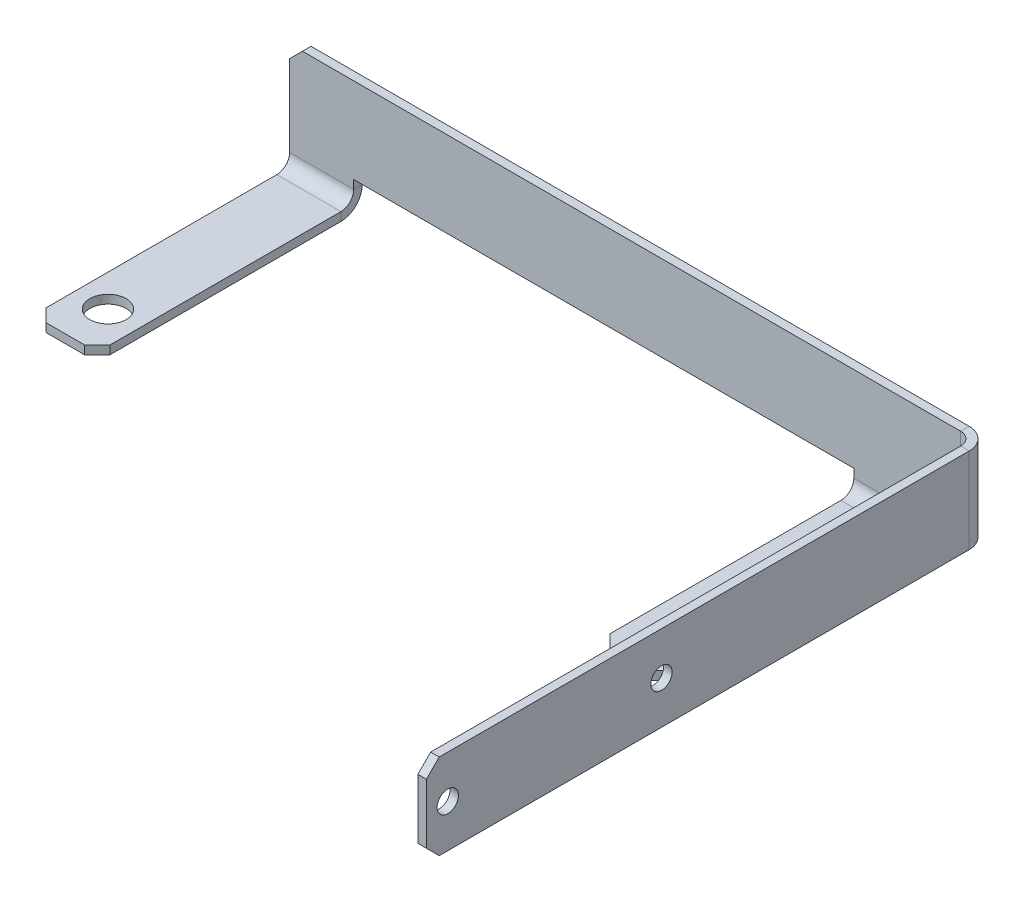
ISO-10303-21;
HEADER;
FILE_DESCRIPTION(('STEP AP214'),'2;1');
FILE_NAME('part.step','',(''),(''),'','','');
FILE_SCHEMA(('AUTOMOTIVE_DESIGN { 1 0 10303 214 1 1 1 1 }'));
ENDSEC;
DATA;
#1=APPLICATION_CONTEXT('core data for automotive mechanical design processes');
#2=APPLICATION_PROTOCOL_DEFINITION('international standard','automotive_design',2000,#1);
#3=PRODUCT_CONTEXT('',#1,'mechanical');
#4=PRODUCT('Part','Part','',(#3));
#5=PRODUCT_RELATED_PRODUCT_CATEGORY('part','',(#4));
#6=PRODUCT_DEFINITION_FORMATION('','',#4);
#7=PRODUCT_DEFINITION_CONTEXT('part definition',#1,'design');
#8=PRODUCT_DEFINITION('design','',#6,#7);
#9=PRODUCT_DEFINITION_SHAPE('','',#8);
#10=(LENGTH_UNIT() NAMED_UNIT(*) SI_UNIT(.MILLI.,.METRE.));
#11=(NAMED_UNIT(*) PLANE_ANGLE_UNIT() SI_UNIT($,.RADIAN.));
#12=(NAMED_UNIT(*) SI_UNIT($,.STERADIAN.) SOLID_ANGLE_UNIT());
#13=UNCERTAINTY_MEASURE_WITH_UNIT(LENGTH_MEASURE(1.E-05),#10,'distance_accuracy_value','');
#14=(GEOMETRIC_REPRESENTATION_CONTEXT(3) GLOBAL_UNCERTAINTY_ASSIGNED_CONTEXT((#13)) GLOBAL_UNIT_ASSIGNED_CONTEXT((#10,
#11,#12)) REPRESENTATION_CONTEXT('',''));
#15=CARTESIAN_POINT('',(0.,0.,0.));
#16=DIRECTION('',(0.,0.,1.));
#17=DIRECTION('',(1.,0.,0.));
#18=AXIS2_PLACEMENT_3D('',#15,#16,#17);
#19=CARTESIAN_POINT('',(81.,-9.99999999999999,2.));
#20=DIRECTION('',(0.,0.,-1.));
#21=DIRECTION('',(-1.,0.,0.));
#22=AXIS2_PLACEMENT_3D('',#19,#20,#21);
#23=PLANE('',#22);
#24=DIRECTION('',(-1.,0.,0.));
#25=VECTOR('',#24,1.);
#26=CARTESIAN_POINT('',(-81.,10.,2.));
#27=LINE('',#26,#25);
#28=CARTESIAN_POINT('',(76.,10.,2.00000000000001));
#29=VERTEX_POINT('',#28);
#30=CARTESIAN_POINT('',(-78.,10.,2.));
#31=VERTEX_POINT('',#30);
#32=EDGE_CURVE('E417',#29,#31,#27,.T.);
#33=ORIENTED_EDGE('',*,*,#32,.T.);
#34=DIRECTION('',(0.707106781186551,0.707106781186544,0.));
#35=VECTOR('',#34,1.);
#36=CARTESIAN_POINT('',(-81.,7.00000000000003,2.));
#37=LINE('',#36,#35);
#38=CARTESIAN_POINT('',(-81.,7.00000000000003,2.));
#39=VERTEX_POINT('',#38);
#40=EDGE_CURVE('E463',#31,#39,#37,.F.);
#41=ORIENTED_EDGE('',*,*,#40,.T.);
#42=DIRECTION('',(0.,-1.,0.));
#43=VECTOR('',#42,1.);
#44=CARTESIAN_POINT('',(-81.,10.,2.));
#45=LINE('',#44,#43);
#46=CARTESIAN_POINT('',(-81.,-12.,2.));
#47=VERTEX_POINT('',#46);
#48=EDGE_CURVE('E421',#39,#47,#45,.T.);
#49=ORIENTED_EDGE('',*,*,#48,.T.);
#50=DIRECTION('',(1.,0.,0.));
#51=VECTOR('',#50,1.);
#52=CARTESIAN_POINT('',(-66.,-12.,2.));
#53=LINE('',#52,#51);
#54=CARTESIAN_POINT('',(-66.,-12.,2.));
#55=VERTEX_POINT('',#54);
#56=EDGE_CURVE('E403',#55,#47,#53,.F.);
#57=ORIENTED_EDGE('',*,*,#56,.F.);
#58=DIRECTION('',(0.,1.,0.));
#59=VECTOR('',#58,1.);
#60=CARTESIAN_POINT('',(-66.,-9.99999999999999,2.));
#61=LINE('',#60,#59);
#62=CARTESIAN_POINT('',(-66.,-9.99999999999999,2.));
#63=VERTEX_POINT('',#62);
#64=EDGE_CURVE('E423',#55,#63,#61,.T.);
#65=ORIENTED_EDGE('',*,*,#64,.T.);
#66=DIRECTION('',(1.,0.,0.));
#67=VECTOR('',#66,1.);
#68=CARTESIAN_POINT('',(-66.,-9.99999999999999,2.));
#69=LINE('',#68,#67);
#70=CARTESIAN_POINT('',(51.,-9.99999999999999,2.));
#71=VERTEX_POINT('',#70);
#72=EDGE_CURVE('E425',#63,#71,#69,.T.);
#73=ORIENTED_EDGE('',*,*,#72,.T.);
#74=DIRECTION('',(0.,-1.,0.));
#75=VECTOR('',#74,1.);
#76=CARTESIAN_POINT('',(51.,-9.99999999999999,2.));
#77=LINE('',#76,#75);
#78=CARTESIAN_POINT('',(51.,-12.,2.));
#79=VERTEX_POINT('',#78);
#80=EDGE_CURVE('E427',#71,#79,#77,.T.);
#81=ORIENTED_EDGE('',*,*,#80,.T.);
#82=DIRECTION('',(1.,0.,0.));
#83=VECTOR('',#82,1.);
#84=CARTESIAN_POINT('',(66.,-12.,2.));
#85=LINE('',#84,#83);
#86=CARTESIAN_POINT('',(66.,-12.,2.));
#87=VERTEX_POINT('',#86);
#88=EDGE_CURVE('E356',#87,#79,#85,.F.);
#89=ORIENTED_EDGE('',*,*,#88,.F.);
#90=DIRECTION('',(0.,1.,0.));
#91=VECTOR('',#90,1.);
#92=CARTESIAN_POINT('',(66.,-9.99999999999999,2.));
#93=LINE('',#92,#91);
#94=CARTESIAN_POINT('',(66.,-9.99999999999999,2.));
#95=VERTEX_POINT('',#94);
#96=EDGE_CURVE('E430',#87,#95,#93,.T.);
#97=ORIENTED_EDGE('',*,*,#96,.T.);
#98=DIRECTION('',(1.,0.,0.));
#99=VECTOR('',#98,1.);
#100=CARTESIAN_POINT('',(66.,-9.99999999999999,2.));
#101=LINE('',#100,#99);
#102=CARTESIAN_POINT('',(76.,-9.99999999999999,2.00000000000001));
#103=VERTEX_POINT('',#102);
#104=EDGE_CURVE('E414',#95,#103,#101,.T.);
#105=ORIENTED_EDGE('',*,*,#104,.T.);
#106=DIRECTION('',(0.,1.,0.));
#107=VECTOR('',#106,1.);
#108=CARTESIAN_POINT('',(76.,10.,2.00000000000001));
#109=LINE('',#108,#107);
#110=EDGE_CURVE('E308',#29,#103,#109,.F.);
#111=ORIENTED_EDGE('',*,*,#110,.F.);
#112=EDGE_LOOP('',(#33,#41,#49,#57,#65,#73,#81,#89,#97,#105,#111));
#113=FACE_BOUND('',#112,.T.);
#114=ADVANCED_FACE('F54',(#113),#23,.F.);
#115=CARTESIAN_POINT('',(81.,-9.99999999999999,0.));
#116=DIRECTION('',(0.,0.,-1.));
#117=DIRECTION('',(-1.,0.,0.));
#118=AXIS2_PLACEMENT_3D('',#115,#116,#117);
#119=PLANE('',#118);
#120=DIRECTION('',(0.,-1.,0.));
#121=VECTOR('',#120,1.);
#122=CARTESIAN_POINT('',(-81.,-10.,0.));
#123=LINE('',#122,#121);
#124=CARTESIAN_POINT('',(-81.,7.00000000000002,0.));
#125=VERTEX_POINT('',#124);
#126=CARTESIAN_POINT('',(-81.,-12.,0.));
#127=VERTEX_POINT('',#126);
#128=EDGE_CURVE('E438',#125,#127,#123,.T.);
#129=ORIENTED_EDGE('',*,*,#128,.F.);
#130=DIRECTION('',(-0.707106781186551,-0.707106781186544,0.));
#131=VECTOR('',#130,1.);
#132=CARTESIAN_POINT('',(-8.49999999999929,79.5000000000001,0.));
#133=LINE('',#132,#131);
#134=CARTESIAN_POINT('',(-78.,10.,0.));
#135=VERTEX_POINT('',#134);
#136=EDGE_CURVE('E459',#125,#135,#133,.F.);
#137=ORIENTED_EDGE('',*,*,#136,.T.);
#138=DIRECTION('',(-1.,0.,0.));
#139=VECTOR('',#138,1.);
#140=CARTESIAN_POINT('',(-81.,10.,0.));
#141=LINE('',#140,#139);
#142=CARTESIAN_POINT('',(76.,10.,0.));
#143=VERTEX_POINT('',#142);
#144=EDGE_CURVE('E435',#143,#135,#141,.T.);
#145=ORIENTED_EDGE('',*,*,#144,.F.);
#146=DIRECTION('',(0.,1.,0.));
#147=VECTOR('',#146,1.);
#148=CARTESIAN_POINT('',(76.,10.,0.));
#149=LINE('',#148,#147);
#150=CARTESIAN_POINT('',(76.,-9.99999999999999,0.));
#151=VERTEX_POINT('',#150);
#152=EDGE_CURVE('E255',#143,#151,#149,.F.);
#153=ORIENTED_EDGE('',*,*,#152,.T.);
#154=DIRECTION('',(1.,0.,0.));
#155=VECTOR('',#154,1.);
#156=CARTESIAN_POINT('',(66.,-9.99999999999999,0.));
#157=LINE('',#156,#155);
#158=CARTESIAN_POINT('',(66.,-9.99999999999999,0.));
#159=VERTEX_POINT('',#158);
#160=EDGE_CURVE('E411',#159,#151,#157,.T.);
#161=ORIENTED_EDGE('',*,*,#160,.F.);
#162=DIRECTION('',(0.,1.,0.));
#163=VECTOR('',#162,1.);
#164=CARTESIAN_POINT('',(66.,-9.99999999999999,0.));
#165=LINE('',#164,#163);
#166=CARTESIAN_POINT('',(66.,-12.,0.));
#167=VERTEX_POINT('',#166);
#168=EDGE_CURVE('E418',#167,#159,#165,.T.);
#169=ORIENTED_EDGE('',*,*,#168,.F.);
#170=DIRECTION('',(1.,0.,0.));
#171=VECTOR('',#170,1.);
#172=CARTESIAN_POINT('',(66.,-12.,0.));
#173=LINE('',#172,#171);
#174=CARTESIAN_POINT('',(51.,-12.,0.));
#175=VERTEX_POINT('',#174);
#176=EDGE_CURVE('E343',#167,#175,#173,.F.);
#177=ORIENTED_EDGE('',*,*,#176,.T.);
#178=DIRECTION('',(0.,-1.,0.));
#179=VECTOR('',#178,1.);
#180=CARTESIAN_POINT('',(51.,-9.99999999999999,0.));
#181=LINE('',#180,#179);
#182=CARTESIAN_POINT('',(51.,-9.99999999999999,0.));
#183=VERTEX_POINT('',#182);
#184=EDGE_CURVE('E444',#183,#175,#181,.T.);
#185=ORIENTED_EDGE('',*,*,#184,.F.);
#186=DIRECTION('',(1.,0.,0.));
#187=VECTOR('',#186,1.);
#188=CARTESIAN_POINT('',(-66.,-9.99999999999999,0.));
#189=LINE('',#188,#187);
#190=CARTESIAN_POINT('',(-66.,-9.99999999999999,0.));
#191=VERTEX_POINT('',#190);
#192=EDGE_CURVE('E442',#191,#183,#189,.T.);
#193=ORIENTED_EDGE('',*,*,#192,.F.);
#194=DIRECTION('',(0.,1.,0.));
#195=VECTOR('',#194,1.);
#196=CARTESIAN_POINT('',(-66.,-9.99999999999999,0.));
#197=LINE('',#196,#195);
#198=CARTESIAN_POINT('',(-66.,-12.,0.));
#199=VERTEX_POINT('',#198);
#200=EDGE_CURVE('E440',#199,#191,#197,.T.);
#201=ORIENTED_EDGE('',*,*,#200,.F.);
#202=DIRECTION('',(1.,0.,0.));
#203=VECTOR('',#202,1.);
#204=CARTESIAN_POINT('',(-66.,-12.,0.));
#205=LINE('',#204,#203);
#206=EDGE_CURVE('E390',#199,#127,#205,.F.);
#207=ORIENTED_EDGE('',*,*,#206,.T.);
#208=EDGE_LOOP('',(#129,#137,#145,#153,#161,#169,#177,#185,#193,#201,#207));
#209=FACE_BOUND('',#208,.T.);
#210=ADVANCED_FACE('F551',(#209),#119,.T.);
#211=CARTESIAN_POINT('',(66.,-9.99999999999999,2.));
#212=DIRECTION('',(0.,1.,0.));
#213=DIRECTION('',(-1.,0.,0.));
#214=AXIS2_PLACEMENT_3D('',#211,#212,#213);
#215=PLANE('',#214);
#216=DIRECTION('',(0.,0.,-1.));
#217=VECTOR('',#216,1.);
#218=CARTESIAN_POINT('',(76.,-9.99999999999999,2.00000000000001));
#219=LINE('',#218,#217);
#220=EDGE_CURVE('E311',#103,#151,#219,.T.);
#221=ORIENTED_EDGE('',*,*,#220,.F.);
#222=ORIENTED_EDGE('',*,*,#104,.F.);
#223=DIRECTION('',(0.,0.,-1.));
#224=VECTOR('',#223,1.);
#225=CARTESIAN_POINT('',(66.,-9.99999999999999,2.));
#226=LINE('',#225,#224);
#227=EDGE_CURVE('E432',#95,#159,#226,.T.);
#228=ORIENTED_EDGE('',*,*,#227,.T.);
#229=ORIENTED_EDGE('',*,*,#160,.T.);
#230=EDGE_LOOP('',(#221,#222,#228,#229));
#231=FACE_BOUND('',#230,.T.);
#232=ADVANCED_FACE('F579',(#231),#215,.F.);
#233=CARTESIAN_POINT('',(-81.,10.,2.));
#234=DIRECTION('',(0.,-1.,0.));
#235=DIRECTION('',(0.,0.,-1.));
#236=AXIS2_PLACEMENT_3D('',#233,#234,#235);
#237=PLANE('',#236);
#238=ORIENTED_EDGE('',*,*,#144,.T.);
#239=DIRECTION('',(0.,0.,1.));
#240=VECTOR('',#239,1.);
#241=CARTESIAN_POINT('',(-78.,10.,2.));
#242=LINE('',#241,#240);
#243=EDGE_CURVE('E461',#135,#31,#242,.T.);
#244=ORIENTED_EDGE('',*,*,#243,.T.);
#245=ORIENTED_EDGE('',*,*,#32,.F.);
#246=DIRECTION('',(0.,0.,-1.));
#247=VECTOR('',#246,1.);
#248=CARTESIAN_POINT('',(76.,10.,2.00000000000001));
#249=LINE('',#248,#247);
#250=EDGE_CURVE('E304',#29,#143,#249,.T.);
#251=ORIENTED_EDGE('',*,*,#250,.T.);
#252=EDGE_LOOP('',(#238,#244,#245,#251));
#253=FACE_BOUND('',#252,.T.);
#254=ADVANCED_FACE('F574',(#253),#237,.F.);
#255=CARTESIAN_POINT('',(51.,-9.99999999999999,2.));
#256=DIRECTION('',(1.,0.,0.));
#257=DIRECTION('',(0.,0.,-1.));
#258=AXIS2_PLACEMENT_3D('',#255,#256,#257);
#259=PLANE('',#258);
#260=DIRECTION('',(0.,0.,-1.));
#261=VECTOR('',#260,1.);
#262=CARTESIAN_POINT('',(51.,-12.,2.));
#263=LINE('',#262,#261);
#264=EDGE_CURVE('E360',#79,#175,#263,.T.);
#265=ORIENTED_EDGE('',*,*,#264,.F.);
#266=ORIENTED_EDGE('',*,*,#80,.F.);
#267=DIRECTION('',(0.,0.,-1.));
#268=VECTOR('',#267,1.);
#269=CARTESIAN_POINT('',(51.,-9.99999999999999,2.));
#270=LINE('',#269,#268);
#271=EDGE_CURVE('E450',#71,#183,#270,.T.);
#272=ORIENTED_EDGE('',*,*,#271,.T.);
#273=ORIENTED_EDGE('',*,*,#184,.T.);
#274=EDGE_LOOP('',(#265,#266,#272,#273));
#275=FACE_BOUND('',#274,.T.);
#276=ADVANCED_FACE('F588',(#275),#259,.F.);
#277=CARTESIAN_POINT('',(66.,-9.99999999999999,2.));
#278=DIRECTION('',(-1.,0.,0.));
#279=DIRECTION('',(0.,0.,1.));
#280=AXIS2_PLACEMENT_3D('',#277,#278,#279);
#281=PLANE('',#280);
#282=DIRECTION('',(0.,0.,-1.));
#283=VECTOR('',#282,1.);
#284=CARTESIAN_POINT('',(66.,-12.,2.));
#285=LINE('',#284,#283);
#286=EDGE_CURVE('E350',#87,#167,#285,.T.);
#287=ORIENTED_EDGE('',*,*,#286,.T.);
#288=ORIENTED_EDGE('',*,*,#168,.T.);
#289=ORIENTED_EDGE('',*,*,#227,.F.);
#290=ORIENTED_EDGE('',*,*,#96,.F.);
#291=EDGE_LOOP('',(#287,#288,#289,#290));
#292=FACE_BOUND('',#291,.T.);
#293=ADVANCED_FACE('F584',(#292),#281,.F.);
#294=CARTESIAN_POINT('',(-81.,-10.,2.));
#295=DIRECTION('',(1.,0.,0.));
#296=DIRECTION('',(0.,0.,-1.));
#297=AXIS2_PLACEMENT_3D('',#294,#295,#296);
#298=PLANE('',#297);
#299=ORIENTED_EDGE('',*,*,#48,.F.);
#300=DIRECTION('',(0.,0.,-1.));
#301=VECTOR('',#300,1.);
#302=CARTESIAN_POINT('',(-81.,7.00000000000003,2.));
#303=LINE('',#302,#301);
#304=EDGE_CURVE('E456',#39,#125,#303,.T.);
#305=ORIENTED_EDGE('',*,*,#304,.T.);
#306=ORIENTED_EDGE('',*,*,#128,.T.);
#307=DIRECTION('',(0.,0.,-1.));
#308=VECTOR('',#307,1.);
#309=CARTESIAN_POINT('',(-81.,-12.,2.));
#310=LINE('',#309,#308);
#311=EDGE_CURVE('E408',#47,#127,#310,.T.);
#312=ORIENTED_EDGE('',*,*,#311,.F.);
#313=EDGE_LOOP('',(#299,#305,#306,#312));
#314=FACE_BOUND('',#313,.T.);
#315=ADVANCED_FACE('F547',(#314),#298,.F.);
#316=CARTESIAN_POINT('',(-66.,-9.99999999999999,2.));
#317=DIRECTION('',(-1.,0.,0.));
#318=DIRECTION('',(0.,0.,1.));
#319=AXIS2_PLACEMENT_3D('',#316,#317,#318);
#320=PLANE('',#319);
#321=DIRECTION('',(0.,0.,-1.));
#322=VECTOR('',#321,1.);
#323=CARTESIAN_POINT('',(-66.,-12.,2.));
#324=LINE('',#323,#322);
#325=EDGE_CURVE('E397',#55,#199,#324,.T.);
#326=ORIENTED_EDGE('',*,*,#325,.T.);
#327=ORIENTED_EDGE('',*,*,#200,.T.);
#328=DIRECTION('',(0.,0.,-1.));
#329=VECTOR('',#328,1.);
#330=CARTESIAN_POINT('',(-66.,-9.99999999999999,2.));
#331=LINE('',#330,#329);
#332=EDGE_CURVE('E453',#63,#191,#331,.T.);
#333=ORIENTED_EDGE('',*,*,#332,.F.);
#334=ORIENTED_EDGE('',*,*,#64,.F.);
#335=EDGE_LOOP('',(#326,#327,#333,#334));
#336=FACE_BOUND('',#335,.T.);
#337=ADVANCED_FACE('F558',(#336),#320,.F.);
#338=CARTESIAN_POINT('',(-66.,-9.99999999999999,2.));
#339=DIRECTION('',(0.,1.,0.));
#340=DIRECTION('',(0.,0.,1.));
#341=AXIS2_PLACEMENT_3D('',#338,#339,#340);
#342=PLANE('',#341);
#343=ORIENTED_EDGE('',*,*,#192,.T.);
#344=ORIENTED_EDGE('',*,*,#271,.F.);
#345=ORIENTED_EDGE('',*,*,#72,.F.);
#346=ORIENTED_EDGE('',*,*,#332,.T.);
#347=EDGE_LOOP('',(#343,#344,#345,#346));
#348=FACE_BOUND('',#347,.T.);
#349=ADVANCED_FACE('F562',(#348),#342,.F.);
#350=CARTESIAN_POINT('',(-81.,-12.,5.));
#351=DIRECTION('',(-1.,0.,0.));
#352=DIRECTION('',(0.,0.,1.));
#353=AXIS2_PLACEMENT_3D('',#350,#351,#352);
#354=PLANE('',#353);
#355=DIRECTION('',(0.,-1.,0.));
#356=VECTOR('',#355,1.);
#357=CARTESIAN_POINT('',(-81.,-15.,4.99999999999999));
#358=LINE('',#357,#356);
#359=CARTESIAN_POINT('',(-81.,-15.,4.99999999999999));
#360=VERTEX_POINT('',#359);
#361=CARTESIAN_POINT('',(-81.,-17.,4.99999999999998));
#362=VERTEX_POINT('',#361);
#363=EDGE_CURVE('E363',#360,#362,#358,.T.);
#364=ORIENTED_EDGE('',*,*,#363,.F.);
#365=CARTESIAN_POINT('',(-81.,-12.,5.));
#366=DIRECTION('',(1.,0.,0.));
#367=DIRECTION('',(0.,0.,-1.));
#368=AXIS2_PLACEMENT_3D('',#365,#366,#367);
#369=CIRCLE('',#368,3.);
#370=EDGE_CURVE('E400',#47,#360,#369,.F.);
#371=ORIENTED_EDGE('',*,*,#370,.F.);
#372=ORIENTED_EDGE('',*,*,#311,.T.);
#373=CARTESIAN_POINT('',(-81.,-12.,5.));
#374=DIRECTION('',(1.,0.,0.));
#375=DIRECTION('',(0.,0.,-1.));
#376=AXIS2_PLACEMENT_3D('',#373,#374,#375);
#377=CIRCLE('',#376,5.);
#378=EDGE_CURVE('E393',#127,#362,#377,.F.);
#379=ORIENTED_EDGE('',*,*,#378,.T.);
#380=EDGE_LOOP('',(#364,#371,#372,#379));
#381=FACE_BOUND('',#380,.T.);
#382=ADVANCED_FACE('F535',(#381),#354,.T.);
#383=CARTESIAN_POINT('',(-66.,-12.,5.));
#384=DIRECTION('',(-1.,0.,0.));
#385=DIRECTION('',(0.,0.,1.));
#386=AXIS2_PLACEMENT_3D('',#383,#384,#385);
#387=PLANE('',#386);
#388=CARTESIAN_POINT('',(-66.,-12.,5.));
#389=DIRECTION('',(1.,0.,0.));
#390=DIRECTION('',(0.,0.,-1.));
#391=AXIS2_PLACEMENT_3D('',#388,#389,#390);
#392=CIRCLE('',#391,3.);
#393=CARTESIAN_POINT('',(-66.,-15.,4.99999999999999));
#394=VERTEX_POINT('',#393);
#395=EDGE_CURVE('E384',#394,#55,#392,.T.);
#396=ORIENTED_EDGE('',*,*,#395,.F.);
#397=DIRECTION('',(0.,-1.,0.));
#398=VECTOR('',#397,1.);
#399=CARTESIAN_POINT('',(-66.,-15.,4.99999999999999));
#400=LINE('',#399,#398);
#401=CARTESIAN_POINT('',(-66.,-17.,4.99999999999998));
#402=VERTEX_POINT('',#401);
#403=EDGE_CURVE('E368',#394,#402,#400,.T.);
#404=ORIENTED_EDGE('',*,*,#403,.T.);
#405=CARTESIAN_POINT('',(-66.,-12.,5.));
#406=DIRECTION('',(1.,0.,0.));
#407=DIRECTION('',(0.,0.,-1.));
#408=AXIS2_PLACEMENT_3D('',#405,#406,#407);
#409=CIRCLE('',#408,5.);
#410=EDGE_CURVE('E394',#402,#199,#409,.T.);
#411=ORIENTED_EDGE('',*,*,#410,.T.);
#412=ORIENTED_EDGE('',*,*,#325,.F.);
#413=EDGE_LOOP('',(#396,#404,#411,#412));
#414=FACE_BOUND('',#413,.T.);
#415=ADVANCED_FACE('F529',(#414),#387,.F.);
#416=CARTESIAN_POINT('',(-66.,-12.,5.));
#417=DIRECTION('',(1.,0.,0.));
#418=DIRECTION('',(0.,-1.,0.));
#419=AXIS2_PLACEMENT_3D('',#416,#417,#418);
#420=CYLINDRICAL_SURFACE('',#419,5.);
#421=ORIENTED_EDGE('',*,*,#206,.F.);
#422=ORIENTED_EDGE('',*,*,#410,.F.);
#423=DIRECTION('',(-1.,0.,0.));
#424=VECTOR('',#423,1.);
#425=CARTESIAN_POINT('',(-66.,-17.,4.99999999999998));
#426=LINE('',#425,#424);
#427=EDGE_CURVE('E371',#402,#362,#426,.T.);
#428=ORIENTED_EDGE('',*,*,#427,.T.);
#429=ORIENTED_EDGE('',*,*,#378,.F.);
#430=EDGE_LOOP('',(#421,#422,#428,#429));
#431=FACE_BOUND('',#430,.T.);
#432=ADVANCED_FACE('F532',(#431),#420,.T.);
#433=CARTESIAN_POINT('',(-66.,-12.,5.));
#434=DIRECTION('',(1.,0.,0.));
#435=DIRECTION('',(0.,-1.,0.));
#436=AXIS2_PLACEMENT_3D('',#433,#434,#435);
#437=CYLINDRICAL_SURFACE('',#436,3.);
#438=ORIENTED_EDGE('',*,*,#56,.T.);
#439=ORIENTED_EDGE('',*,*,#370,.T.);
#440=DIRECTION('',(1.,0.,0.));
#441=VECTOR('',#440,1.);
#442=CARTESIAN_POINT('',(-81.,-15.,4.99999999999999));
#443=LINE('',#442,#441);
#444=EDGE_CURVE('E366',#360,#394,#443,.T.);
#445=ORIENTED_EDGE('',*,*,#444,.T.);
#446=ORIENTED_EDGE('',*,*,#395,.T.);
#447=EDGE_LOOP('',(#438,#439,#445,#446));
#448=FACE_BOUND('',#447,.T.);
#449=ADVANCED_FACE('F543',(#448),#437,.F.);
#450=CARTESIAN_POINT('',(-66.,-17.0000000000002,62.));
#451=DIRECTION('',(-1.,0.,0.));
#452=DIRECTION('',(0.,0.,1.));
#453=AXIS2_PLACEMENT_3D('',#450,#451,#452);
#454=PLANE('',#453);
#455=DIRECTION('',(0.,0.,1.));
#456=VECTOR('',#455,1.);
#457=CARTESIAN_POINT('',(-66.,-15.0000000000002,62.));
#458=LINE('',#457,#456);
#459=CARTESIAN_POINT('',(-66.,-15.0000000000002,59.));
#460=VERTEX_POINT('',#459);
#461=EDGE_CURVE('E376',#394,#460,#458,.T.);
#462=ORIENTED_EDGE('',*,*,#461,.T.);
#463=DIRECTION('',(0.,-1.,0.));
#464=VECTOR('',#463,1.);
#465=CARTESIAN_POINT('',(-66.,-17.0000000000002,59.));
#466=LINE('',#465,#464);
#467=CARTESIAN_POINT('',(-66.,-17.0000000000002,59.));
#468=VERTEX_POINT('',#467);
#469=EDGE_CURVE('E77',#460,#468,#466,.T.);
#470=ORIENTED_EDGE('',*,*,#469,.T.);
#471=DIRECTION('',(0.,0.,1.));
#472=VECTOR('',#471,1.);
#473=CARTESIAN_POINT('',(-66.,-17.0000000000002,62.));
#474=LINE('',#473,#472);
#475=EDGE_CURVE('E377',#402,#468,#474,.T.);
#476=ORIENTED_EDGE('',*,*,#475,.F.);
#477=ORIENTED_EDGE('',*,*,#403,.F.);
#478=EDGE_LOOP('',(#462,#470,#476,#477));
#479=FACE_BOUND('',#478,.T.);
#480=ADVANCED_FACE('F526',(#479),#454,.F.);
#481=CARTESIAN_POINT('',(-81.,-17.,1.99999999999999));
#482=DIRECTION('',(1.,0.,0.));
#483=DIRECTION('',(0.,0.,-1.));
#484=AXIS2_PLACEMENT_3D('',#481,#482,#483);
#485=PLANE('',#484);
#486=DIRECTION('',(0.,0.,-1.));
#487=VECTOR('',#486,1.);
#488=CARTESIAN_POINT('',(-81.,-17.,1.99999999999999));
#489=LINE('',#488,#487);
#490=CARTESIAN_POINT('',(-81.,-17.0000000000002,59.));
#491=VERTEX_POINT('',#490);
#492=EDGE_CURVE('E382',#491,#362,#489,.T.);
#493=ORIENTED_EDGE('',*,*,#492,.F.);
#494=DIRECTION('',(0.,1.,0.));
#495=VECTOR('',#494,1.);
#496=CARTESIAN_POINT('',(-81.,-17.0000000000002,59.));
#497=LINE('',#496,#495);
#498=CARTESIAN_POINT('',(-81.,-15.0000000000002,59.));
#499=VERTEX_POINT('',#498);
#500=EDGE_CURVE('E13',#491,#499,#497,.T.);
#501=ORIENTED_EDGE('',*,*,#500,.T.);
#502=DIRECTION('',(0.,0.,-1.));
#503=VECTOR('',#502,1.);
#504=CARTESIAN_POINT('',(-81.,-15.,2.));
#505=LINE('',#504,#503);
#506=EDGE_CURVE('E380',#499,#360,#505,.T.);
#507=ORIENTED_EDGE('',*,*,#506,.T.);
#508=ORIENTED_EDGE('',*,*,#363,.T.);
#509=EDGE_LOOP('',(#493,#501,#507,#508));
#510=FACE_BOUND('',#509,.T.);
#511=ADVANCED_FACE('F539',(#510),#485,.F.);
#512=CARTESIAN_POINT('',(-66.,-17.,1.99999999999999));
#513=DIRECTION('',(0.,1.,0.));
#514=DIRECTION('',(0.,0.,1.));
#515=AXIS2_PLACEMENT_3D('',#512,#513,#514);
#516=PLANE('',#515);
#517=CARTESIAN_POINT('',(-73.5,-17.0000000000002,52.));
#518=DIRECTION('',(0.,1.,0.));
#519=DIRECTION('',(0.,0.,1.));
#520=AXIS2_PLACEMENT_3D('',#517,#518,#519);
#521=CIRCLE('',#520,4.25000000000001);
#522=CARTESIAN_POINT('',(-73.5,-17.0000000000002,56.25));
#523=VERTEX_POINT('',#522);
#524=EDGE_CURVE('E301',#523,#523,#521,.F.);
#525=ORIENTED_EDGE('',*,*,#524,.F.);
#526=EDGE_LOOP('',(#525));
#527=FACE_BOUND('',#526,.T.);
#528=ORIENTED_EDGE('',*,*,#475,.T.);
#529=DIRECTION('',(0.707106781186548,0.,-0.707106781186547));
#530=VECTOR('',#529,1.);
#531=CARTESIAN_POINT('',(-69.,-17.0000000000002,62.));
#532=LINE('',#531,#530);
#533=CARTESIAN_POINT('',(-69.,-17.0000000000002,62.));
#534=VERTEX_POINT('',#533);
#535=EDGE_CURVE('E62',#468,#534,#532,.F.);
#536=ORIENTED_EDGE('',*,*,#535,.T.);
#537=DIRECTION('',(-1.,0.,0.));
#538=VECTOR('',#537,1.);
#539=CARTESIAN_POINT('',(-81.,-17.0000000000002,62.));
#540=LINE('',#539,#538);
#541=CARTESIAN_POINT('',(-78.,-17.0000000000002,62.));
#542=VERTEX_POINT('',#541);
#543=EDGE_CURVE('E379',#534,#542,#540,.T.);
#544=ORIENTED_EDGE('',*,*,#543,.T.);
#545=DIRECTION('',(0.707106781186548,0.,0.707106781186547));
#546=VECTOR('',#545,1.);
#547=CARTESIAN_POINT('',(-81.,-17.0000000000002,59.));
#548=LINE('',#547,#546);
#549=EDGE_CURVE('E69',#542,#491,#548,.F.);
#550=ORIENTED_EDGE('',*,*,#549,.T.);
#551=ORIENTED_EDGE('',*,*,#492,.T.);
#552=ORIENTED_EDGE('',*,*,#427,.F.);
#553=EDGE_LOOP('',(#528,#536,#544,#550,#551,#552));
#554=FACE_BOUND('',#553,.T.);
#555=ADVANCED_FACE('F512',(#527,#554),#516,.F.);
#556=CARTESIAN_POINT('',(-66.,-15.,2.));
#557=DIRECTION('',(0.,1.,0.));
#558=DIRECTION('',(0.,0.,1.));
#559=AXIS2_PLACEMENT_3D('',#556,#557,#558);
#560=PLANE('',#559);
#561=CARTESIAN_POINT('',(-73.5,-15.0000000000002,52.));
#562=DIRECTION('',(0.,1.,0.));
#563=DIRECTION('',(0.,0.,1.));
#564=AXIS2_PLACEMENT_3D('',#561,#562,#563);
#565=CIRCLE('',#564,4.25000000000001);
#566=CARTESIAN_POINT('',(-73.5,-15.0000000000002,56.25));
#567=VERTEX_POINT('',#566);
#568=EDGE_CURVE('E1127',#567,#567,#565,.T.);
#569=ORIENTED_EDGE('',*,*,#568,.F.);
#570=EDGE_LOOP('',(#569));
#571=FACE_BOUND('',#570,.T.);
#572=DIRECTION('',(-1.,0.,0.));
#573=VECTOR('',#572,1.);
#574=CARTESIAN_POINT('',(-81.,-15.0000000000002,62.));
#575=LINE('',#574,#573);
#576=CARTESIAN_POINT('',(-69.,-15.0000000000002,62.));
#577=VERTEX_POINT('',#576);
#578=CARTESIAN_POINT('',(-78.,-15.0000000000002,62.));
#579=VERTEX_POINT('',#578);
#580=EDGE_CURVE('E386',#577,#579,#575,.T.);
#581=ORIENTED_EDGE('',*,*,#580,.F.);
#582=DIRECTION('',(-0.707106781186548,0.,0.707106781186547));
#583=VECTOR('',#582,1.);
#584=CARTESIAN_POINT('',(-37.5,-15.0000000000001,30.5000000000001));
#585=LINE('',#584,#583);
#586=EDGE_CURVE('E507',#577,#460,#585,.F.);
#587=ORIENTED_EDGE('',*,*,#586,.T.);
#588=ORIENTED_EDGE('',*,*,#461,.F.);
#589=ORIENTED_EDGE('',*,*,#444,.F.);
#590=ORIENTED_EDGE('',*,*,#506,.F.);
#591=DIRECTION('',(-0.707106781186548,0.,-0.707106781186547));
#592=VECTOR('',#591,1.);
#593=CARTESIAN_POINT('',(-102.,-15.0000000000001,38.0000000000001));
#594=LINE('',#593,#592);
#595=EDGE_CURVE('E505',#499,#579,#594,.F.);
#596=ORIENTED_EDGE('',*,*,#595,.T.);
#597=EDGE_LOOP('',(#581,#587,#588,#589,#590,#596));
#598=FACE_BOUND('',#597,.T.);
#599=ADVANCED_FACE('F523',(#571,#598),#560,.T.);
#600=CARTESIAN_POINT('',(-81.,-17.0000000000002,62.));
#601=DIRECTION('',(0.,0.,-1.));
#602=DIRECTION('',(0.,1.,0.));
#603=AXIS2_PLACEMENT_3D('',#600,#601,#602);
#604=PLANE('',#603);
#605=ORIENTED_EDGE('',*,*,#543,.F.);
#606=DIRECTION('',(0.,1.,0.));
#607=VECTOR('',#606,1.);
#608=CARTESIAN_POINT('',(-69.,-17.0000000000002,62.));
#609=LINE('',#608,#607);
#610=EDGE_CURVE('E502',#534,#577,#609,.T.);
#611=ORIENTED_EDGE('',*,*,#610,.T.);
#612=ORIENTED_EDGE('',*,*,#580,.T.);
#613=DIRECTION('',(0.,-1.,0.));
#614=VECTOR('',#613,1.);
#615=CARTESIAN_POINT('',(-78.,-17.0000000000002,62.));
#616=LINE('',#615,#614);
#617=EDGE_CURVE('E500',#579,#542,#616,.T.);
#618=ORIENTED_EDGE('',*,*,#617,.T.);
#619=EDGE_LOOP('',(#605,#611,#612,#618));
#620=FACE_BOUND('',#619,.T.);
#621=ADVANCED_FACE('F517',(#620),#604,.F.);
#622=CARTESIAN_POINT('',(51.,-12.,5.));
#623=DIRECTION('',(-1.,0.,0.));
#624=DIRECTION('',(0.,0.,1.));
#625=AXIS2_PLACEMENT_3D('',#622,#623,#624);
#626=PLANE('',#625);
#627=DIRECTION('',(0.,-1.,0.));
#628=VECTOR('',#627,1.);
#629=CARTESIAN_POINT('',(51.,-15.,4.99999999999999));
#630=LINE('',#629,#628);
#631=CARTESIAN_POINT('',(51.,-15.,4.99999999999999));
#632=VERTEX_POINT('',#631);
#633=CARTESIAN_POINT('',(51.,-17.,4.99999999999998));
#634=VERTEX_POINT('',#633);
#635=EDGE_CURVE('E314',#632,#634,#630,.T.);
#636=ORIENTED_EDGE('',*,*,#635,.F.);
#637=CARTESIAN_POINT('',(51.,-12.,5.));
#638=DIRECTION('',(1.,0.,0.));
#639=DIRECTION('',(0.,0.,-1.));
#640=AXIS2_PLACEMENT_3D('',#637,#638,#639);
#641=CIRCLE('',#640,3.);
#642=EDGE_CURVE('E353',#79,#632,#641,.F.);
#643=ORIENTED_EDGE('',*,*,#642,.F.);
#644=ORIENTED_EDGE('',*,*,#264,.T.);
#645=CARTESIAN_POINT('',(51.,-12.,5.));
#646=DIRECTION('',(1.,0.,0.));
#647=DIRECTION('',(0.,0.,-1.));
#648=AXIS2_PLACEMENT_3D('',#645,#646,#647);
#649=CIRCLE('',#648,5.);
#650=EDGE_CURVE('E346',#175,#634,#649,.F.);
#651=ORIENTED_EDGE('',*,*,#650,.T.);
#652=EDGE_LOOP('',(#636,#643,#644,#651));
#653=FACE_BOUND('',#652,.T.);
#654=ADVANCED_FACE('F592',(#653),#626,.T.);
#655=CARTESIAN_POINT('',(66.,-12.,5.));
#656=DIRECTION('',(-1.,0.,0.));
#657=DIRECTION('',(0.,0.,1.));
#658=AXIS2_PLACEMENT_3D('',#655,#656,#657);
#659=PLANE('',#658);
#660=CARTESIAN_POINT('',(66.,-12.,5.));
#661=DIRECTION('',(1.,0.,0.));
#662=DIRECTION('',(0.,0.,-1.));
#663=AXIS2_PLACEMENT_3D('',#660,#661,#662);
#664=CIRCLE('',#663,3.);
#665=CARTESIAN_POINT('',(66.,-15.,4.99999999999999));
#666=VERTEX_POINT('',#665);
#667=EDGE_CURVE('E336',#666,#87,#664,.T.);
#668=ORIENTED_EDGE('',*,*,#667,.F.);
#669=DIRECTION('',(0.,-1.,0.));
#670=VECTOR('',#669,1.);
#671=CARTESIAN_POINT('',(66.,-15.,4.99999999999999));
#672=LINE('',#671,#670);
#673=CARTESIAN_POINT('',(66.,-17.,4.99999999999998));
#674=VERTEX_POINT('',#673);
#675=EDGE_CURVE('E318',#666,#674,#672,.T.);
#676=ORIENTED_EDGE('',*,*,#675,.T.);
#677=CARTESIAN_POINT('',(66.,-12.,5.));
#678=DIRECTION('',(1.,0.,0.));
#679=DIRECTION('',(0.,0.,-1.));
#680=AXIS2_PLACEMENT_3D('',#677,#678,#679);
#681=CIRCLE('',#680,5.);
#682=EDGE_CURVE('E347',#674,#167,#681,.T.);
#683=ORIENTED_EDGE('',*,*,#682,.T.);
#684=ORIENTED_EDGE('',*,*,#286,.F.);
#685=EDGE_LOOP('',(#668,#676,#683,#684));
#686=FACE_BOUND('',#685,.T.);
#687=ADVANCED_FACE('F634',(#686),#659,.F.);
#688=CARTESIAN_POINT('',(66.,-12.,5.));
#689=DIRECTION('',(1.,0.,0.));
#690=DIRECTION('',(0.,-1.,0.));
#691=AXIS2_PLACEMENT_3D('',#688,#689,#690);
#692=CYLINDRICAL_SURFACE('',#691,5.);
#693=ORIENTED_EDGE('',*,*,#176,.F.);
#694=ORIENTED_EDGE('',*,*,#682,.F.);
#695=DIRECTION('',(-1.,0.,0.));
#696=VECTOR('',#695,1.);
#697=CARTESIAN_POINT('',(51.,-17.,4.99999999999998));
#698=LINE('',#697,#696);
#699=EDGE_CURVE('E321',#674,#634,#698,.T.);
#700=ORIENTED_EDGE('',*,*,#699,.T.);
#701=ORIENTED_EDGE('',*,*,#650,.F.);
#702=EDGE_LOOP('',(#693,#694,#700,#701));
#703=FACE_BOUND('',#702,.T.);
#704=ADVANCED_FACE('F632',(#703),#692,.T.);
#705=CARTESIAN_POINT('',(66.,-12.,5.));
#706=DIRECTION('',(1.,0.,0.));
#707=DIRECTION('',(0.,-1.,0.));
#708=AXIS2_PLACEMENT_3D('',#705,#706,#707);
#709=CYLINDRICAL_SURFACE('',#708,3.);
#710=ORIENTED_EDGE('',*,*,#88,.T.);
#711=ORIENTED_EDGE('',*,*,#642,.T.);
#712=DIRECTION('',(1.,0.,0.));
#713=VECTOR('',#712,1.);
#714=CARTESIAN_POINT('',(51.,-15.,4.99999999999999));
#715=LINE('',#714,#713);
#716=EDGE_CURVE('E316',#632,#666,#715,.T.);
#717=ORIENTED_EDGE('',*,*,#716,.T.);
#718=ORIENTED_EDGE('',*,*,#667,.T.);
#719=EDGE_LOOP('',(#710,#711,#717,#718));
#720=FACE_BOUND('',#719,.T.);
#721=ADVANCED_FACE('F595',(#720),#709,.F.);
#722=CARTESIAN_POINT('',(51.,-17.,1.99999999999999));
#723=DIRECTION('',(1.,0.,0.));
#724=DIRECTION('',(0.,0.,-1.));
#725=AXIS2_PLACEMENT_3D('',#722,#723,#724);
#726=PLANE('',#725);
#727=DIRECTION('',(0.,0.,-1.));
#728=VECTOR('',#727,1.);
#729=CARTESIAN_POINT('',(51.,-17.,1.99999999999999));
#730=LINE('',#729,#728);
#731=CARTESIAN_POINT('',(51.,-17.0000000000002,59.));
#732=VERTEX_POINT('',#731);
#733=EDGE_CURVE('E327',#732,#634,#730,.T.);
#734=ORIENTED_EDGE('',*,*,#733,.F.);
#735=DIRECTION('',(0.,1.,0.));
#736=VECTOR('',#735,1.);
#737=CARTESIAN_POINT('',(51.,-17.0000000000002,59.));
#738=LINE('',#737,#736);
#739=CARTESIAN_POINT('',(51.,-15.0000000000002,59.));
#740=VERTEX_POINT('',#739);
#741=EDGE_CURVE('E497',#732,#740,#738,.T.);
#742=ORIENTED_EDGE('',*,*,#741,.T.);
#743=DIRECTION('',(0.,0.,-1.));
#744=VECTOR('',#743,1.);
#745=CARTESIAN_POINT('',(51.,-15.,2.));
#746=LINE('',#745,#744);
#747=EDGE_CURVE('E326',#740,#632,#746,.T.);
#748=ORIENTED_EDGE('',*,*,#747,.T.);
#749=ORIENTED_EDGE('',*,*,#635,.T.);
#750=EDGE_LOOP('',(#734,#742,#748,#749));
#751=FACE_BOUND('',#750,.T.);
#752=ADVANCED_FACE('F624',(#751),#726,.F.);
#753=CARTESIAN_POINT('',(66.,-17.0000000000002,62.));
#754=DIRECTION('',(-1.,0.,0.));
#755=DIRECTION('',(0.,0.,1.));
#756=AXIS2_PLACEMENT_3D('',#753,#754,#755);
#757=PLANE('',#756);
#758=DIRECTION('',(0.,0.,1.));
#759=VECTOR('',#758,1.);
#760=CARTESIAN_POINT('',(66.,-15.0000000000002,62.));
#761=LINE('',#760,#759);
#762=CARTESIAN_POINT('',(66.,-15.0000000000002,59.));
#763=VERTEX_POINT('',#762);
#764=EDGE_CURVE('E338',#666,#763,#761,.T.);
#765=ORIENTED_EDGE('',*,*,#764,.T.);
#766=DIRECTION('',(0.,-1.,0.));
#767=VECTOR('',#766,1.);
#768=CARTESIAN_POINT('',(66.,-17.0000000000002,59.));
#769=LINE('',#768,#767);
#770=CARTESIAN_POINT('',(66.,-17.0000000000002,59.));
#771=VERTEX_POINT('',#770);
#772=EDGE_CURVE('E491',#763,#771,#769,.T.);
#773=ORIENTED_EDGE('',*,*,#772,.T.);
#774=DIRECTION('',(0.,0.,1.));
#775=VECTOR('',#774,1.);
#776=CARTESIAN_POINT('',(66.,-17.0000000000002,62.));
#777=LINE('',#776,#775);
#778=EDGE_CURVE('E329',#674,#771,#777,.T.);
#779=ORIENTED_EDGE('',*,*,#778,.F.);
#780=ORIENTED_EDGE('',*,*,#675,.F.);
#781=EDGE_LOOP('',(#765,#773,#779,#780));
#782=FACE_BOUND('',#781,.T.);
#783=ADVANCED_FACE('F605',(#782),#757,.F.);
#784=CARTESIAN_POINT('',(51.,-17.0000000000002,62.));
#785=DIRECTION('',(0.,1.,0.));
#786=DIRECTION('',(0.,0.,1.));
#787=AXIS2_PLACEMENT_3D('',#784,#785,#786);
#788=PLANE('',#787);
#789=CARTESIAN_POINT('',(58.5,-17.0000000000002,52.));
#790=DIRECTION('',(0.,1.,0.));
#791=DIRECTION('',(0.,0.,1.));
#792=AXIS2_PLACEMENT_3D('',#789,#790,#791);
#793=CIRCLE('',#792,4.25);
#794=CARTESIAN_POINT('',(58.5,-17.0000000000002,56.25));
#795=VERTEX_POINT('',#794);
#796=EDGE_CURVE('E1130',#795,#795,#793,.F.);
#797=ORIENTED_EDGE('',*,*,#796,.F.);
#798=EDGE_LOOP('',(#797));
#799=FACE_BOUND('',#798,.T.);
#800=ORIENTED_EDGE('',*,*,#778,.T.);
#801=DIRECTION('',(0.707106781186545,0.,-0.70710678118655));
#802=VECTOR('',#801,1.);
#803=CARTESIAN_POINT('',(63.,-17.0000000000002,62.));
#804=LINE('',#803,#802);
#805=CARTESIAN_POINT('',(63.,-17.0000000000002,62.));
#806=VERTEX_POINT('',#805);
#807=EDGE_CURVE('E495',#771,#806,#804,.F.);
#808=ORIENTED_EDGE('',*,*,#807,.T.);
#809=DIRECTION('',(-1.,0.,0.));
#810=VECTOR('',#809,1.);
#811=CARTESIAN_POINT('',(51.,-17.0000000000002,62.));
#812=LINE('',#811,#810);
#813=CARTESIAN_POINT('',(54.,-17.0000000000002,62.));
#814=VERTEX_POINT('',#813);
#815=EDGE_CURVE('E333',#806,#814,#812,.T.);
#816=ORIENTED_EDGE('',*,*,#815,.T.);
#817=DIRECTION('',(0.707106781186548,0.,0.707106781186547));
#818=VECTOR('',#817,1.);
#819=CARTESIAN_POINT('',(51.,-17.0000000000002,59.));
#820=LINE('',#819,#818);
#821=EDGE_CURVE('E493',#814,#732,#820,.F.);
#822=ORIENTED_EDGE('',*,*,#821,.T.);
#823=ORIENTED_EDGE('',*,*,#733,.T.);
#824=ORIENTED_EDGE('',*,*,#699,.F.);
#825=EDGE_LOOP('',(#800,#808,#816,#822,#823,#824));
#826=FACE_BOUND('',#825,.T.);
#827=ADVANCED_FACE('F613',(#799,#826),#788,.F.);
#828=CARTESIAN_POINT('',(51.,-15.0000000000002,62.));
#829=DIRECTION('',(0.,1.,0.));
#830=DIRECTION('',(0.,0.,1.));
#831=AXIS2_PLACEMENT_3D('',#828,#829,#830);
#832=PLANE('',#831);
#833=CARTESIAN_POINT('',(58.5,-15.0000000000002,52.));
#834=DIRECTION('',(0.,1.,0.));
#835=DIRECTION('',(0.,0.,1.));
#836=AXIS2_PLACEMENT_3D('',#833,#834,#835);
#837=CIRCLE('',#836,4.25);
#838=CARTESIAN_POINT('',(58.5,-15.0000000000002,56.25));
#839=VERTEX_POINT('',#838);
#840=EDGE_CURVE('E1135',#839,#839,#837,.T.);
#841=ORIENTED_EDGE('',*,*,#840,.F.);
#842=EDGE_LOOP('',(#841));
#843=FACE_BOUND('',#842,.T.);
#844=DIRECTION('',(-1.,0.,0.));
#845=VECTOR('',#844,1.);
#846=CARTESIAN_POINT('',(51.,-15.0000000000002,62.));
#847=LINE('',#846,#845);
#848=CARTESIAN_POINT('',(63.,-15.0000000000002,62.));
#849=VERTEX_POINT('',#848);
#850=CARTESIAN_POINT('',(54.,-15.0000000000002,62.));
#851=VERTEX_POINT('',#850);
#852=EDGE_CURVE('E330',#849,#851,#847,.T.);
#853=ORIENTED_EDGE('',*,*,#852,.F.);
#854=DIRECTION('',(-0.707106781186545,0.,0.70710678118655));
#855=VECTOR('',#854,1.);
#856=CARTESIAN_POINT('',(57.,-15.0000000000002,68.));
#857=LINE('',#856,#855);
#858=EDGE_CURVE('E489',#849,#763,#857,.F.);
#859=ORIENTED_EDGE('',*,*,#858,.T.);
#860=ORIENTED_EDGE('',*,*,#764,.F.);
#861=ORIENTED_EDGE('',*,*,#716,.F.);
#862=ORIENTED_EDGE('',*,*,#747,.F.);
#863=DIRECTION('',(-0.707106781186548,0.,-0.707106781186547));
#864=VECTOR('',#863,1.);
#865=CARTESIAN_POINT('',(52.5,-15.0000000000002,60.5));
#866=LINE('',#865,#864);
#867=EDGE_CURVE('E487',#740,#851,#866,.F.);
#868=ORIENTED_EDGE('',*,*,#867,.T.);
#869=EDGE_LOOP('',(#853,#859,#860,#861,#862,#868));
#870=FACE_BOUND('',#869,.T.);
#871=ADVANCED_FACE('F601',(#843,#870),#832,.T.);
#872=CARTESIAN_POINT('',(51.,-17.0000000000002,62.));
#873=DIRECTION('',(0.,0.,-1.));
#874=DIRECTION('',(0.,1.,0.));
#875=AXIS2_PLACEMENT_3D('',#872,#873,#874);
#876=PLANE('',#875);
#877=ORIENTED_EDGE('',*,*,#815,.F.);
#878=DIRECTION('',(0.,1.,0.));
#879=VECTOR('',#878,1.);
#880=CARTESIAN_POINT('',(63.,-17.0000000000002,62.));
#881=LINE('',#880,#879);
#882=EDGE_CURVE('E484',#806,#849,#881,.T.);
#883=ORIENTED_EDGE('',*,*,#882,.T.);
#884=ORIENTED_EDGE('',*,*,#852,.T.);
#885=DIRECTION('',(0.,-1.,0.));
#886=VECTOR('',#885,1.);
#887=CARTESIAN_POINT('',(54.,-17.0000000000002,62.));
#888=LINE('',#887,#886);
#889=EDGE_CURVE('E482',#851,#814,#888,.T.);
#890=ORIENTED_EDGE('',*,*,#889,.T.);
#891=EDGE_LOOP('',(#877,#883,#884,#890));
#892=FACE_BOUND('',#891,.T.);
#893=ADVANCED_FACE('F617',(#892),#876,.F.);
#894=CARTESIAN_POINT('',(76.,-9.99999999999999,5.));
#895=DIRECTION('',(0.,-1.,0.));
#896=DIRECTION('',(0.,0.,-1.));
#897=AXIS2_PLACEMENT_3D('',#894,#895,#896);
#898=PLANE('',#897);
#899=DIRECTION('',(-1.,0.,0.));
#900=VECTOR('',#899,1.);
#901=CARTESIAN_POINT('',(81.,-9.99999999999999,4.99999999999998));
#902=LINE('',#901,#900);
#903=CARTESIAN_POINT('',(79.,-9.99999999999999,4.99999999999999));
#904=VERTEX_POINT('',#903);
#905=CARTESIAN_POINT('',(81.,-9.99999999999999,4.99999999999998));
#906=VERTEX_POINT('',#905);
#907=EDGE_CURVE('E298',#904,#906,#902,.F.);
#908=ORIENTED_EDGE('',*,*,#907,.F.);
#909=CARTESIAN_POINT('',(76.,-9.99999999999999,5.));
#910=DIRECTION('',(0.,1.,0.));
#911=DIRECTION('',(0.,0.,1.));
#912=AXIS2_PLACEMENT_3D('',#909,#910,#911);
#913=CIRCLE('',#912,2.99999999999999);
#914=EDGE_CURVE('E258',#103,#904,#913,.F.);
#915=ORIENTED_EDGE('',*,*,#914,.F.);
#916=ORIENTED_EDGE('',*,*,#220,.T.);
#917=CARTESIAN_POINT('',(76.,-9.99999999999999,5.));
#918=DIRECTION('',(0.,1.,0.));
#919=DIRECTION('',(0.,0.,1.));
#920=AXIS2_PLACEMENT_3D('',#917,#918,#919);
#921=CIRCLE('',#920,4.99999999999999);
#922=EDGE_CURVE('E303',#151,#906,#921,.F.);
#923=ORIENTED_EDGE('',*,*,#922,.T.);
#924=EDGE_LOOP('',(#908,#915,#916,#923));
#925=FACE_BOUND('',#924,.T.);
#926=ADVANCED_FACE('F783',(#925),#898,.T.);
#927=CARTESIAN_POINT('',(76.,10.,5.));
#928=DIRECTION('',(0.,-1.,0.));
#929=DIRECTION('',(0.,0.,-1.));
#930=AXIS2_PLACEMENT_3D('',#927,#928,#929);
#931=PLANE('',#930);
#932=CARTESIAN_POINT('',(76.,10.,5.));
#933=DIRECTION('',(0.,1.,0.));
#934=DIRECTION('',(0.,0.,1.));
#935=AXIS2_PLACEMENT_3D('',#932,#933,#934);
#936=CIRCLE('',#935,2.99999999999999);
#937=CARTESIAN_POINT('',(79.,10.,4.99999999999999));
#938=VERTEX_POINT('',#937);
#939=EDGE_CURVE('E265',#938,#29,#936,.T.);
#940=ORIENTED_EDGE('',*,*,#939,.F.);
#941=DIRECTION('',(-1.,0.,0.));
#942=VECTOR('',#941,1.);
#943=CARTESIAN_POINT('',(79.,10.,4.99999999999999));
#944=LINE('',#943,#942);
#945=CARTESIAN_POINT('',(81.,10.,4.99999999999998));
#946=VERTEX_POINT('',#945);
#947=EDGE_CURVE('E262',#938,#946,#944,.F.);
#948=ORIENTED_EDGE('',*,*,#947,.T.);
#949=CARTESIAN_POINT('',(76.,10.,5.));
#950=DIRECTION('',(0.,1.,0.));
#951=DIRECTION('',(0.,0.,1.));
#952=AXIS2_PLACEMENT_3D('',#949,#950,#951);
#953=CIRCLE('',#952,4.99999999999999);
#954=EDGE_CURVE('E248',#946,#143,#953,.T.);
#955=ORIENTED_EDGE('',*,*,#954,.T.);
#956=ORIENTED_EDGE('',*,*,#250,.F.);
#957=EDGE_LOOP('',(#940,#948,#955,#956));
#958=FACE_BOUND('',#957,.T.);
#959=ADVANCED_FACE('F263',(#958),#931,.F.);
#960=CARTESIAN_POINT('',(76.,10.,5.));
#961=DIRECTION('',(0.,1.,0.));
#962=DIRECTION('',(1.,0.,0.));
#963=AXIS2_PLACEMENT_3D('',#960,#961,#962);
#964=CYLINDRICAL_SURFACE('',#963,4.99999999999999);
#965=ORIENTED_EDGE('',*,*,#152,.F.);
#966=ORIENTED_EDGE('',*,*,#954,.F.);
#967=DIRECTION('',(0.,1.,0.));
#968=VECTOR('',#967,1.);
#969=CARTESIAN_POINT('',(81.,-9.99999999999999,4.99999999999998));
#970=LINE('',#969,#968);
#971=EDGE_CURVE('E252',#946,#906,#970,.F.);
#972=ORIENTED_EDGE('',*,*,#971,.T.);
#973=ORIENTED_EDGE('',*,*,#922,.F.);
#974=EDGE_LOOP('',(#965,#966,#972,#973));
#975=FACE_BOUND('',#974,.T.);
#976=ADVANCED_FACE('F250',(#975),#964,.T.);
#977=CARTESIAN_POINT('',(76.,10.,5.));
#978=DIRECTION('',(0.,1.,0.));
#979=DIRECTION('',(1.,0.,0.));
#980=AXIS2_PLACEMENT_3D('',#977,#978,#979);
#981=CYLINDRICAL_SURFACE('',#980,2.99999999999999);
#982=ORIENTED_EDGE('',*,*,#110,.T.);
#983=ORIENTED_EDGE('',*,*,#914,.T.);
#984=DIRECTION('',(0.,1.,0.));
#985=VECTOR('',#984,1.);
#986=CARTESIAN_POINT('',(79.,-9.99999999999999,4.99999999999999));
#987=LINE('',#986,#985);
#988=EDGE_CURVE('E270',#904,#938,#987,.T.);
#989=ORIENTED_EDGE('',*,*,#988,.T.);
#990=ORIENTED_EDGE('',*,*,#939,.T.);
#991=EDGE_LOOP('',(#982,#983,#989,#990));
#992=FACE_BOUND('',#991,.T.);
#993=ADVANCED_FACE('F770',(#992),#981,.F.);
#994=CARTESIAN_POINT('',(81.,-9.99999999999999,1.99999999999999));
#995=DIRECTION('',(0.,1.,0.));
#996=DIRECTION('',(-1.,0.,0.));
#997=AXIS2_PLACEMENT_3D('',#994,#995,#996);
#998=PLANE('',#997);
#999=DIRECTION('',(0.,0.,-1.));
#1000=VECTOR('',#999,1.);
#1001=CARTESIAN_POINT('',(81.0000000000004,-9.99999999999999,132.));
#1002=LINE('',#1001,#1000);
#1003=CARTESIAN_POINT('',(81.0000000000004,-9.99999999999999,129.));
#1004=VERTEX_POINT('',#1003);
#1005=EDGE_CURVE('E279',#1004,#906,#1002,.T.);
#1006=ORIENTED_EDGE('',*,*,#1005,.F.);
#1007=DIRECTION('',(-1.,0.,0.));
#1008=VECTOR('',#1007,1.);
#1009=CARTESIAN_POINT('',(81.0000000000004,-9.99999999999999,129.));
#1010=LINE('',#1009,#1008);
#1011=CARTESIAN_POINT('',(79.0000000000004,-9.99999999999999,129.));
#1012=VERTEX_POINT('',#1011);
#1013=EDGE_CURVE('E465',#1004,#1012,#1010,.T.);
#1014=ORIENTED_EDGE('',*,*,#1013,.T.);
#1015=DIRECTION('',(0.,0.,1.));
#1016=VECTOR('',#1015,1.);
#1017=CARTESIAN_POINT('',(79.,-9.99999999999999,2.));
#1018=LINE('',#1017,#1016);
#1019=EDGE_CURVE('E280',#1012,#904,#1018,.F.);
#1020=ORIENTED_EDGE('',*,*,#1019,.T.);
#1021=ORIENTED_EDGE('',*,*,#907,.T.);
#1022=EDGE_LOOP('',(#1006,#1014,#1020,#1021));
#1023=FACE_BOUND('',#1022,.T.);
#1024=ADVANCED_FACE('F760',(#1023),#998,.F.);
#1025=CARTESIAN_POINT('',(81.0000000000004,10.,132.));
#1026=DIRECTION('',(0.,-1.,0.));
#1027=DIRECTION('',(1.,0.,0.));
#1028=AXIS2_PLACEMENT_3D('',#1025,#1026,#1027);
#1029=PLANE('',#1028);
#1030=DIRECTION('',(0.,0.,-1.));
#1031=VECTOR('',#1030,1.);
#1032=CARTESIAN_POINT('',(79.0000000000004,10.,132.));
#1033=LINE('',#1032,#1031);
#1034=CARTESIAN_POINT('',(79.0000000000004,10.,129.));
#1035=VERTEX_POINT('',#1034);
#1036=EDGE_CURVE('E294',#938,#1035,#1033,.F.);
#1037=ORIENTED_EDGE('',*,*,#1036,.T.);
#1038=DIRECTION('',(1.,0.,0.));
#1039=VECTOR('',#1038,1.);
#1040=CARTESIAN_POINT('',(81.0000000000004,10.,129.));
#1041=LINE('',#1040,#1039);
#1042=CARTESIAN_POINT('',(81.0000000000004,10.,129.));
#1043=VERTEX_POINT('',#1042);
#1044=EDGE_CURVE('E284',#1035,#1043,#1041,.T.);
#1045=ORIENTED_EDGE('',*,*,#1044,.T.);
#1046=DIRECTION('',(0.,0.,1.));
#1047=VECTOR('',#1046,1.);
#1048=CARTESIAN_POINT('',(81.0000000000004,10.,132.));
#1049=LINE('',#1048,#1047);
#1050=EDGE_CURVE('E276',#946,#1043,#1049,.T.);
#1051=ORIENTED_EDGE('',*,*,#1050,.F.);
#1052=ORIENTED_EDGE('',*,*,#947,.F.);
#1053=EDGE_LOOP('',(#1037,#1045,#1051,#1052));
#1054=FACE_BOUND('',#1053,.T.);
#1055=ADVANCED_FACE('F282',(#1054),#1029,.F.);
#1056=CARTESIAN_POINT('',(81.0000000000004,-9.99999999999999,132.));
#1057=DIRECTION('',(-1.,0.,0.));
#1058=DIRECTION('',(0.,0.,1.));
#1059=AXIS2_PLACEMENT_3D('',#1056,#1057,#1058);
#1060=PLANE('',#1059);
#1061=CARTESIAN_POINT('',(81.0000000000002,0.,77.));
#1062=DIRECTION('',(1.,0.,0.));
#1063=DIRECTION('',(0.,0.,-1.));
#1064=AXIS2_PLACEMENT_3D('',#1061,#1062,#1063);
#1065=CIRCLE('',#1064,2.49999999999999);
#1066=CARTESIAN_POINT('',(81.0000000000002,0.,74.5));
#1067=VERTEX_POINT('',#1066);
#1068=EDGE_CURVE('E1142',#1067,#1067,#1065,.T.);
#1069=ORIENTED_EDGE('',*,*,#1068,.F.);
#1070=EDGE_LOOP('',(#1069));
#1071=FACE_BOUND('',#1070,.T.);
#1072=CARTESIAN_POINT('',(81.0000000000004,0.,127.));
#1073=DIRECTION('',(1.,0.,0.));
#1074=DIRECTION('',(0.,0.,-1.));
#1075=AXIS2_PLACEMENT_3D('',#1072,#1073,#1074);
#1076=CIRCLE('',#1075,2.49999999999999);
#1077=CARTESIAN_POINT('',(81.0000000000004,0.,124.5));
#1078=VERTEX_POINT('',#1077);
#1079=EDGE_CURVE('E1138',#1078,#1078,#1076,.T.);
#1080=ORIENTED_EDGE('',*,*,#1079,.F.);
#1081=EDGE_LOOP('',(#1080));
#1082=FACE_BOUND('',#1081,.T.);
#1083=DIRECTION('',(0.,-1.,0.));
#1084=VECTOR('',#1083,1.);
#1085=CARTESIAN_POINT('',(81.0000000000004,-9.99999999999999,132.));
#1086=LINE('',#1085,#1084);
#1087=CARTESIAN_POINT('',(81.0000000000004,7.00000000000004,132.));
#1088=VERTEX_POINT('',#1087);
#1089=CARTESIAN_POINT('',(81.0000000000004,-7.00000000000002,132.));
#1090=VERTEX_POINT('',#1089);
#1091=EDGE_CURVE('E285',#1088,#1090,#1086,.T.);
#1092=ORIENTED_EDGE('',*,*,#1091,.T.);
#1093=DIRECTION('',(0.,0.707106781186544,0.707106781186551));
#1094=VECTOR('',#1093,1.);
#1095=CARTESIAN_POINT('',(81.0000000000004,-9.99999999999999,129.));
#1096=LINE('',#1095,#1094);
#1097=EDGE_CURVE('E479',#1090,#1004,#1096,.F.);
#1098=ORIENTED_EDGE('',*,*,#1097,.T.);
#1099=ORIENTED_EDGE('',*,*,#1005,.T.);
#1100=ORIENTED_EDGE('',*,*,#971,.F.);
#1101=ORIENTED_EDGE('',*,*,#1050,.T.);
#1102=DIRECTION('',(0.,0.707106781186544,-0.707106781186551));
#1103=VECTOR('',#1102,1.);
#1104=CARTESIAN_POINT('',(81.0000000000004,7.00000000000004,132.));
#1105=LINE('',#1104,#1103);
#1106=EDGE_CURVE('E477',#1043,#1088,#1105,.F.);
#1107=ORIENTED_EDGE('',*,*,#1106,.T.);
#1108=EDGE_LOOP('',(#1092,#1098,#1099,#1100,#1101,#1107));
#1109=FACE_BOUND('',#1108,.T.);
#1110=ADVANCED_FACE('F275',(#1071,#1082,#1109),#1060,.F.);
#1111=CARTESIAN_POINT('',(79.0000000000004,-9.99999999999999,132.));
#1112=DIRECTION('',(-1.,0.,0.));
#1113=DIRECTION('',(0.,0.,1.));
#1114=AXIS2_PLACEMENT_3D('',#1111,#1112,#1113);
#1115=PLANE('',#1114);
#1116=CARTESIAN_POINT('',(79.0000000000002,0.,77.));
#1117=DIRECTION('',(-1.,0.,0.));
#1118=DIRECTION('',(0.,0.,1.));
#1119=AXIS2_PLACEMENT_3D('',#1116,#1117,#1118);
#1120=CIRCLE('',#1119,2.49999999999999);
#1121=CARTESIAN_POINT('',(79.0000000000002,0.,79.5));
#1122=VERTEX_POINT('',#1121);
#1123=EDGE_CURVE('E1145',#1122,#1122,#1120,.F.);
#1124=ORIENTED_EDGE('',*,*,#1123,.T.);
#1125=EDGE_LOOP('',(#1124));
#1126=FACE_BOUND('',#1125,.T.);
#1127=CARTESIAN_POINT('',(79.0000000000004,0.,127.));
#1128=DIRECTION('',(-1.,0.,0.));
#1129=DIRECTION('',(0.,0.,1.));
#1130=AXIS2_PLACEMENT_3D('',#1127,#1128,#1129);
#1131=CIRCLE('',#1130,2.49999999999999);
#1132=CARTESIAN_POINT('',(79.0000000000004,0.,129.5));
#1133=VERTEX_POINT('',#1132);
#1134=EDGE_CURVE('E1139',#1133,#1133,#1131,.F.);
#1135=ORIENTED_EDGE('',*,*,#1134,.T.);
#1136=EDGE_LOOP('',(#1135));
#1137=FACE_BOUND('',#1136,.T.);
#1138=ORIENTED_EDGE('',*,*,#1019,.F.);
#1139=DIRECTION('',(0.,-0.707106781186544,-0.707106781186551));
#1140=VECTOR('',#1139,1.);
#1141=CARTESIAN_POINT('',(79.0000000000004,-8.49999999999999,130.5));
#1142=LINE('',#1141,#1140);
#1143=CARTESIAN_POINT('',(79.0000000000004,-7.00000000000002,132.));
#1144=VERTEX_POINT('',#1143);
#1145=EDGE_CURVE('E470',#1012,#1144,#1142,.F.);
#1146=ORIENTED_EDGE('',*,*,#1145,.T.);
#1147=DIRECTION('',(0.,1.,0.));
#1148=VECTOR('',#1147,1.);
#1149=CARTESIAN_POINT('',(79.0000000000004,-9.99999999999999,132.));
#1150=LINE('',#1149,#1148);
#1151=CARTESIAN_POINT('',(79.0000000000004,7.00000000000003,132.));
#1152=VERTEX_POINT('',#1151);
#1153=EDGE_CURVE('E288',#1152,#1144,#1150,.F.);
#1154=ORIENTED_EDGE('',*,*,#1153,.F.);
#1155=DIRECTION('',(0.,-0.707106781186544,0.707106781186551));
#1156=VECTOR('',#1155,1.);
#1157=CARTESIAN_POINT('',(79.0000000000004,-1.4999999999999,140.5));
#1158=LINE('',#1157,#1156);
#1159=EDGE_CURVE('E468',#1152,#1035,#1158,.F.);
#1160=ORIENTED_EDGE('',*,*,#1159,.T.);
#1161=ORIENTED_EDGE('',*,*,#1036,.F.);
#1162=ORIENTED_EDGE('',*,*,#988,.F.);
#1163=EDGE_LOOP('',(#1138,#1146,#1154,#1160,#1161,#1162));
#1164=FACE_BOUND('',#1163,.T.);
#1165=ADVANCED_FACE('F727',(#1126,#1137,#1164),#1115,.T.);
#1166=CARTESIAN_POINT('',(81.0000000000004,-9.99999999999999,132.));
#1167=DIRECTION('',(0.,0.,-1.));
#1168=DIRECTION('',(-1.,0.,0.));
#1169=AXIS2_PLACEMENT_3D('',#1166,#1167,#1168);
#1170=PLANE('',#1169);
#1171=ORIENTED_EDGE('',*,*,#1153,.T.);
#1172=DIRECTION('',(1.,0.,0.));
#1173=VECTOR('',#1172,1.);
#1174=CARTESIAN_POINT('',(81.0000000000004,-7.00000000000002,132.));
#1175=LINE('',#1174,#1173);
#1176=EDGE_CURVE('E475',#1144,#1090,#1175,.T.);
#1177=ORIENTED_EDGE('',*,*,#1176,.T.);
#1178=ORIENTED_EDGE('',*,*,#1091,.F.);
#1179=DIRECTION('',(-1.,0.,0.));
#1180=VECTOR('',#1179,1.);
#1181=CARTESIAN_POINT('',(81.0000000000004,7.00000000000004,132.));
#1182=LINE('',#1181,#1180);
#1183=EDGE_CURVE('E472',#1088,#1152,#1182,.T.);
#1184=ORIENTED_EDGE('',*,*,#1183,.T.);
#1185=EDGE_LOOP('',(#1171,#1177,#1178,#1184));
#1186=FACE_BOUND('',#1185,.T.);
#1187=ADVANCED_FACE('F721',(#1186),#1170,.F.);
#1188=CARTESIAN_POINT('',(-73.5,-17.0010000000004,52.));
#1189=DIRECTION('',(0.,1.,0.));
#1190=DIRECTION('',(0.,0.,1.));
#1191=AXIS2_PLACEMENT_3D('',#1188,#1189,#1190);
#1192=CYLINDRICAL_SURFACE('',#1191,4.25000000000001);
#1193=ORIENTED_EDGE('',*,*,#568,.T.);
#1194=EDGE_LOOP('',(#1193));
#1195=FACE_BOUND('',#1194,.T.);
#1196=ORIENTED_EDGE('',*,*,#524,.T.);
#1197=EDGE_LOOP('',(#1196));
#1198=FACE_BOUND('',#1197,.T.);
#1199=ADVANCED_FACE('F726',(#1195,#1198),#1192,.F.);
#1200=CARTESIAN_POINT('',(58.5,-17.0010000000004,52.));
#1201=DIRECTION('',(0.,1.,0.));
#1202=DIRECTION('',(0.,0.,1.));
#1203=AXIS2_PLACEMENT_3D('',#1200,#1201,#1202);
#1204=CYLINDRICAL_SURFACE('',#1203,4.25);
#1205=ORIENTED_EDGE('',*,*,#840,.T.);
#1206=EDGE_LOOP('',(#1205));
#1207=FACE_BOUND('',#1206,.T.);
#1208=ORIENTED_EDGE('',*,*,#796,.T.);
#1209=EDGE_LOOP('',(#1208));
#1210=FACE_BOUND('',#1209,.T.);
#1211=ADVANCED_FACE('F913',(#1207,#1210),#1204,.F.);
#1212=CARTESIAN_POINT('',(-81.0010000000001,0.,127.000000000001));
#1213=DIRECTION('',(1.,0.,0.));
#1214=DIRECTION('',(0.,0.,-1.));
#1215=AXIS2_PLACEMENT_3D('',#1212,#1213,#1214);
#1216=CYLINDRICAL_SURFACE('',#1215,2.49999999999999);
#1217=ORIENTED_EDGE('',*,*,#1134,.F.);
#1218=EDGE_LOOP('',(#1217));
#1219=FACE_BOUND('',#1218,.T.);
#1220=ORIENTED_EDGE('',*,*,#1079,.T.);
#1221=EDGE_LOOP('',(#1220));
#1222=FACE_BOUND('',#1221,.T.);
#1223=ADVANCED_FACE('F902',(#1219,#1222),#1216,.F.);
#1224=CARTESIAN_POINT('',(-81.0010000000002,0.,77.0000000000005));
#1225=DIRECTION('',(1.,0.,0.));
#1226=DIRECTION('',(0.,0.,-1.));
#1227=AXIS2_PLACEMENT_3D('',#1224,#1225,#1226);
#1228=CYLINDRICAL_SURFACE('',#1227,2.49999999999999);
#1229=ORIENTED_EDGE('',*,*,#1123,.F.);
#1230=EDGE_LOOP('',(#1229));
#1231=FACE_BOUND('',#1230,.T.);
#1232=ORIENTED_EDGE('',*,*,#1068,.T.);
#1233=EDGE_LOOP('',(#1232));
#1234=FACE_BOUND('',#1233,.T.);
#1235=ADVANCED_FACE('F662',(#1231,#1234),#1228,.F.);
#1236=CARTESIAN_POINT('',(-81.,7.00000000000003,2.));
#1237=DIRECTION('',(0.707106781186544,-0.707106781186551,0.));
#1238=DIRECTION('',(0.707106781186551,0.707106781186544,0.));
#1239=AXIS2_PLACEMENT_3D('',#1236,#1237,#1238);
#1240=PLANE('',#1239);
#1241=ORIENTED_EDGE('',*,*,#40,.F.);
#1242=ORIENTED_EDGE('',*,*,#243,.F.);
#1243=ORIENTED_EDGE('',*,*,#136,.F.);
#1244=ORIENTED_EDGE('',*,*,#304,.F.);
#1245=EDGE_LOOP('',(#1241,#1242,#1243,#1244));
#1246=FACE_BOUND('',#1245,.T.);
#1247=ADVANCED_FACE('F572',(#1246),#1240,.F.);
#1248=CARTESIAN_POINT('',(81.0000000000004,-9.99999999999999,129.));
#1249=DIRECTION('',(0.,0.707106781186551,-0.707106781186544));
#1250=DIRECTION('',(0.,0.707106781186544,0.707106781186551));
#1251=AXIS2_PLACEMENT_3D('',#1248,#1249,#1250);
#1252=PLANE('',#1251);
#1253=ORIENTED_EDGE('',*,*,#1097,.F.);
#1254=ORIENTED_EDGE('',*,*,#1176,.F.);
#1255=ORIENTED_EDGE('',*,*,#1145,.F.);
#1256=ORIENTED_EDGE('',*,*,#1013,.F.);
#1257=EDGE_LOOP('',(#1253,#1254,#1255,#1256));
#1258=FACE_BOUND('',#1257,.T.);
#1259=ADVANCED_FACE('F661',(#1258),#1252,.F.);
#1260=CARTESIAN_POINT('',(81.0000000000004,7.00000000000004,132.));
#1261=DIRECTION('',(0.,-0.707106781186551,-0.707106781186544));
#1262=DIRECTION('',(0.,0.707106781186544,-0.707106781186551));
#1263=AXIS2_PLACEMENT_3D('',#1260,#1261,#1262);
#1264=PLANE('',#1263);
#1265=ORIENTED_EDGE('',*,*,#1106,.F.);
#1266=ORIENTED_EDGE('',*,*,#1044,.F.);
#1267=ORIENTED_EDGE('',*,*,#1159,.F.);
#1268=ORIENTED_EDGE('',*,*,#1183,.F.);
#1269=EDGE_LOOP('',(#1265,#1266,#1267,#1268));
#1270=FACE_BOUND('',#1269,.T.);
#1271=ADVANCED_FACE('F665',(#1270),#1264,.F.);
#1272=CARTESIAN_POINT('',(63.,-17.0000000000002,62.));
#1273=DIRECTION('',(-0.70710678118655,0.,-0.707106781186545));
#1274=DIRECTION('',(-0.707106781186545,0.,0.70710678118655));
#1275=AXIS2_PLACEMENT_3D('',#1272,#1273,#1274);
#1276=PLANE('',#1275);
#1277=ORIENTED_EDGE('',*,*,#807,.F.);
#1278=ORIENTED_EDGE('',*,*,#772,.F.);
#1279=ORIENTED_EDGE('',*,*,#858,.F.);
#1280=ORIENTED_EDGE('',*,*,#882,.F.);
#1281=EDGE_LOOP('',(#1277,#1278,#1279,#1280));
#1282=FACE_BOUND('',#1281,.T.);
#1283=ADVANCED_FACE('F609',(#1282),#1276,.F.);
#1284=CARTESIAN_POINT('',(51.,-17.0000000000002,59.));
#1285=DIRECTION('',(0.707106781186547,0.,-0.707106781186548));
#1286=DIRECTION('',(-0.707106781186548,0.,-0.707106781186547));
#1287=AXIS2_PLACEMENT_3D('',#1284,#1285,#1286);
#1288=PLANE('',#1287);
#1289=ORIENTED_EDGE('',*,*,#821,.F.);
#1290=ORIENTED_EDGE('',*,*,#889,.F.);
#1291=ORIENTED_EDGE('',*,*,#867,.F.);
#1292=ORIENTED_EDGE('',*,*,#741,.F.);
#1293=EDGE_LOOP('',(#1289,#1290,#1291,#1292));
#1294=FACE_BOUND('',#1293,.T.);
#1295=ADVANCED_FACE('F620',(#1294),#1288,.F.);
#1296=CARTESIAN_POINT('',(-69.,-17.0000000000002,62.));
#1297=DIRECTION('',(-0.707106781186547,0.,-0.707106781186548));
#1298=DIRECTION('',(-0.707106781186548,0.,0.707106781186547));
#1299=AXIS2_PLACEMENT_3D('',#1296,#1297,#1298);
#1300=PLANE('',#1299);
#1301=ORIENTED_EDGE('',*,*,#535,.F.);
#1302=ORIENTED_EDGE('',*,*,#469,.F.);
#1303=ORIENTED_EDGE('',*,*,#586,.F.);
#1304=ORIENTED_EDGE('',*,*,#610,.F.);
#1305=EDGE_LOOP('',(#1301,#1302,#1303,#1304));
#1306=FACE_BOUND('',#1305,.T.);
#1307=ADVANCED_FACE('F520',(#1306),#1300,.F.);
#1308=CARTESIAN_POINT('',(-81.,-17.0000000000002,59.));
#1309=DIRECTION('',(0.707106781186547,0.,-0.707106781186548));
#1310=DIRECTION('',(-0.707106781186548,0.,-0.707106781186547));
#1311=AXIS2_PLACEMENT_3D('',#1308,#1309,#1310);
#1312=PLANE('',#1311);
#1313=ORIENTED_EDGE('',*,*,#549,.F.);
#1314=ORIENTED_EDGE('',*,*,#617,.F.);
#1315=ORIENTED_EDGE('',*,*,#595,.F.);
#1316=ORIENTED_EDGE('',*,*,#500,.F.);
#1317=EDGE_LOOP('',(#1313,#1314,#1315,#1316));
#1318=FACE_BOUND('',#1317,.T.);
#1319=ADVANCED_FACE('F56',(#1318),#1312,.F.);
#1320=CLOSED_SHELL('',(#114,#210,#232,#254,#276,#293,#315,#337,#349,#382,#415,#432,#449,#480,
#511,#555,#599,#621,#654,#687,#704,#721,#752,#783,#827,#871,#893,#926,#959,#976,#993,#1024,
#1055,#1110,#1165,#1187,#1199,#1211,#1223,#1235,#1247,#1259,#1271,#1283,#1295,#1307,#1319));
#1321=MANIFOLD_SOLID_BREP('B2',#1320);
#1322=ADVANCED_BREP_SHAPE_REPRESENTATION('',(#18,#1321),#14);
#1323=SHAPE_DEFINITION_REPRESENTATION(#9,#1322);
ENDSEC;
END-ISO-10303-21;
